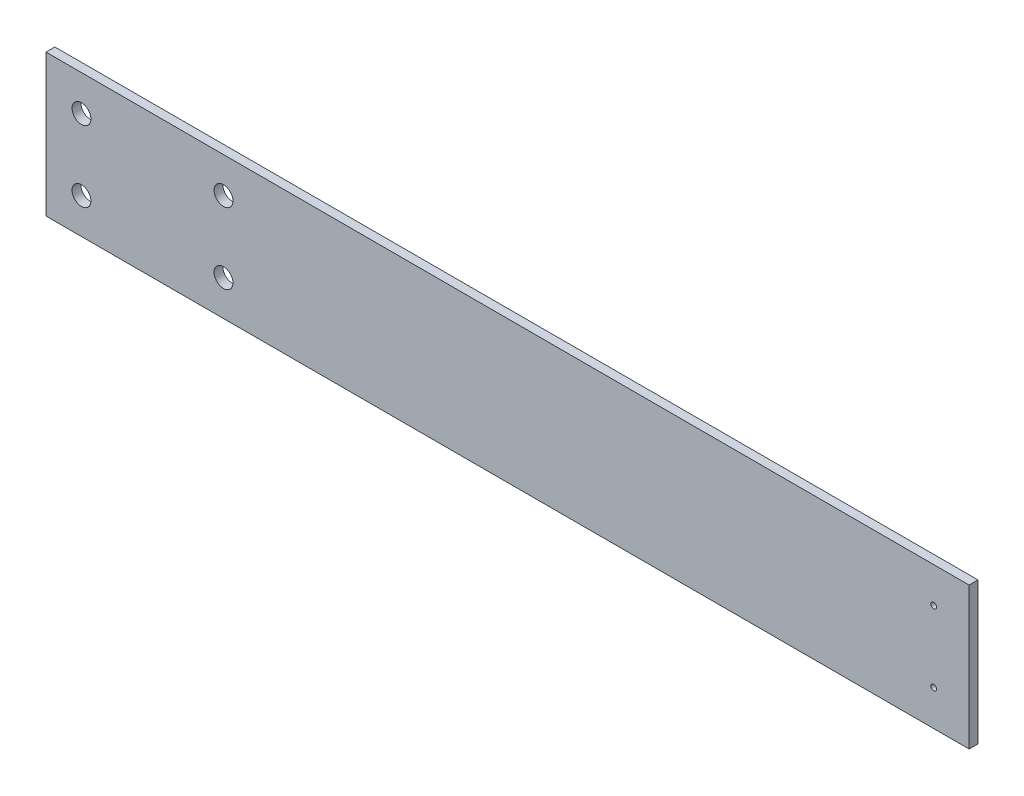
from build123d import *

# Parameters (mm, degrees)
SKETCH2_W               = 330.2
SKETCH2_H               = 50.8
BOSS_EXTRUDE1_DEPTH     = 3.175
F_1_4_CLEARANCE_HOLE1_D = 6.7564
F_1_CLEARANCE_HOLE1_D   = 2.0574


with BuildPart() as part:
    # Sketch2 → Boss-Extrude1 (new body)
    with BuildSketch(Plane.XY):
        with Locations((165.1, 25.4)):
            Rectangle(SKETCH2_W, SKETCH2_H)
    extrude(amount=BOSS_EXTRUDE1_DEPTH)

    # 1_4 Clearance Hole1 (through all)
    with Locations(Plane.XY.offset(3.175)):
        with Locations((12.7, 38.1), (12.7, 12.7), (63.5, 12.7), (63.5, 38.1)):
            Hole(F_1_4_CLEARANCE_HOLE1_D / 2)

    # 1 Clearance Hole1 (through all)
    with Locations(Plane.XY.offset(3.175)):
        with Locations((317.5, 38.1), (317.5, 12.7)):
            Hole(F_1_CLEARANCE_HOLE1_D / 2)


solid = part.part
